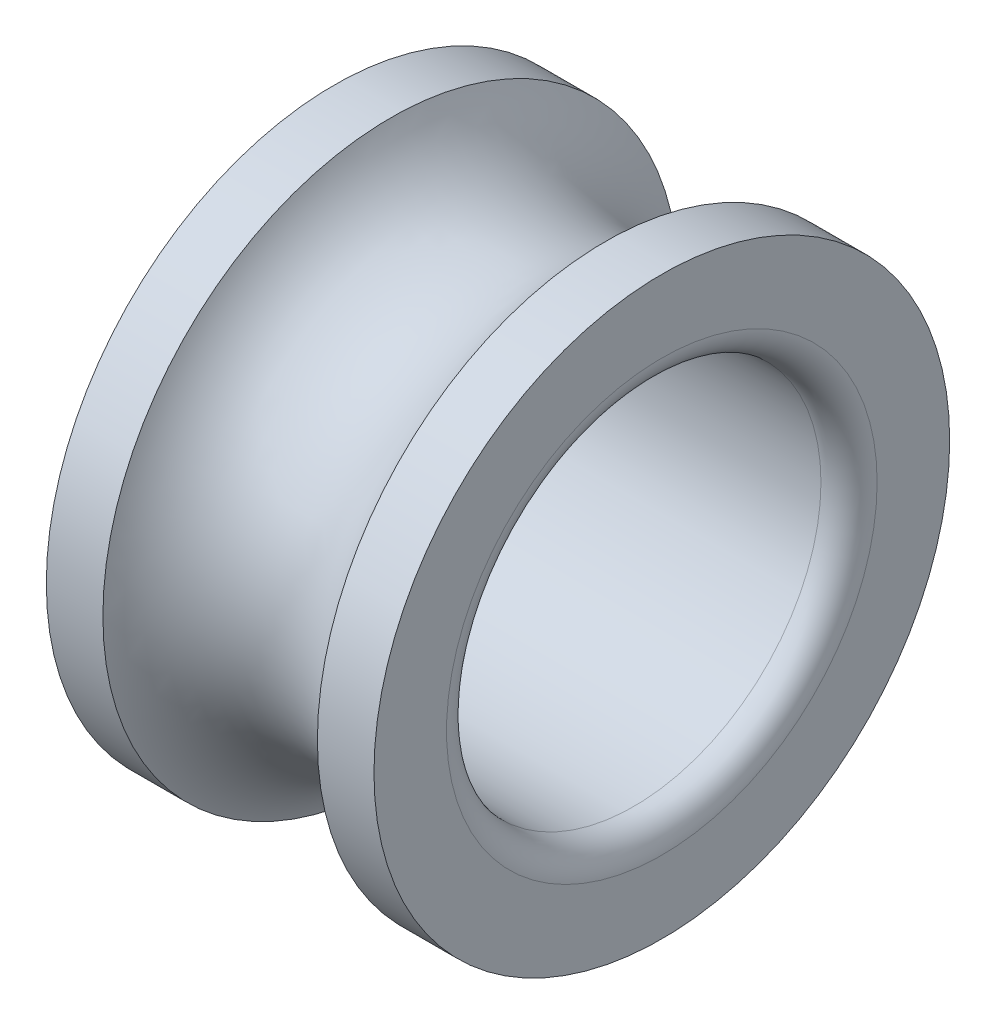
ISO-10303-21;
HEADER;
FILE_DESCRIPTION(('STEP AP214'),'2;1');
FILE_NAME('part.step','',(''),(''),'','','');
FILE_SCHEMA(('AUTOMOTIVE_DESIGN { 1 0 10303 214 1 1 1 1 }'));
ENDSEC;
DATA;
#1=APPLICATION_CONTEXT('core data for automotive mechanical design processes');
#2=APPLICATION_PROTOCOL_DEFINITION('international standard','automotive_design',2000,#1);
#3=PRODUCT_CONTEXT('',#1,'mechanical');
#4=PRODUCT('Part','Part','',(#3));
#5=PRODUCT_RELATED_PRODUCT_CATEGORY('part','',(#4));
#6=PRODUCT_DEFINITION_FORMATION('','',#4);
#7=PRODUCT_DEFINITION_CONTEXT('part definition',#1,'design');
#8=PRODUCT_DEFINITION('design','',#6,#7);
#9=PRODUCT_DEFINITION_SHAPE('','',#8);
#10=(LENGTH_UNIT() NAMED_UNIT(*) SI_UNIT(.MILLI.,.METRE.));
#11=(NAMED_UNIT(*) PLANE_ANGLE_UNIT() SI_UNIT($,.RADIAN.));
#12=(NAMED_UNIT(*) SI_UNIT($,.STERADIAN.) SOLID_ANGLE_UNIT());
#13=UNCERTAINTY_MEASURE_WITH_UNIT(LENGTH_MEASURE(1.E-05),#10,'distance_accuracy_value','');
#14=(GEOMETRIC_REPRESENTATION_CONTEXT(3) GLOBAL_UNCERTAINTY_ASSIGNED_CONTEXT((#13)) GLOBAL_UNIT_ASSIGNED_CONTEXT((#10,
#11,#12)) REPRESENTATION_CONTEXT('',''));
#15=CARTESIAN_POINT('',(0.,0.,0.));
#16=DIRECTION('',(0.,0.,1.));
#17=DIRECTION('',(1.,0.,0.));
#18=AXIS2_PLACEMENT_3D('',#15,#16,#17);
#19=CARTESIAN_POINT('',(0.600000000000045,0.,0.));
#20=DIRECTION('',(1.,0.,0.));
#21=DIRECTION('',(0.,0.,-1.));
#22=AXIS2_PLACEMENT_3D('',#19,#20,#21);
#23=TOROIDAL_SURFACE('',#22,4.60000000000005,0.600000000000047);
#24=CARTESIAN_POINT('',(0.600000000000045,0.,0.));
#25=DIRECTION('',(1.,0.,0.));
#26=DIRECTION('',(0.,0.,-1.));
#27=AXIS2_PLACEMENT_3D('',#24,#25,#26);
#28=CIRCLE('',#27,4.);
#29=CARTESIAN_POINT('',(0.600000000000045,0.,-4.));
#30=VERTEX_POINT('',#29);
#31=EDGE_CURVE('E10',#30,#30,#28,.T.);
#32=ORIENTED_EDGE('',*,*,#31,.T.);
#33=EDGE_LOOP('',(#32));
#34=FACE_BOUND('',#33,.T.);
#35=CARTESIAN_POINT('',(0.,0.,0.));
#36=DIRECTION('',(1.,0.,0.));
#37=DIRECTION('',(0.,0.,-1.));
#38=AXIS2_PLACEMENT_3D('',#35,#36,#37);
#39=CIRCLE('',#38,4.60000000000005);
#40=CARTESIAN_POINT('',(0.,0.,-4.60000000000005));
#41=VERTEX_POINT('',#40);
#42=EDGE_CURVE('E64',#41,#41,#39,.T.);
#43=ORIENTED_EDGE('',*,*,#42,.F.);
#44=EDGE_LOOP('',(#43));
#45=FACE_BOUND('',#44,.T.);
#46=ADVANCED_FACE('F36',(#34,#45),#23,.T.);
#47=CARTESIAN_POINT('',(9.00000000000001,0.,0.));
#48=DIRECTION('',(1.,0.,0.));
#49=DIRECTION('',(0.,0.,-1.));
#50=AXIS2_PLACEMENT_3D('',#47,#48,#49);
#51=CYLINDRICAL_SURFACE('',#50,4.);
#52=CARTESIAN_POINT('',(6.39999999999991,0.,0.));
#53=DIRECTION('',(1.,0.,0.));
#54=DIRECTION('',(0.,0.,-1.));
#55=AXIS2_PLACEMENT_3D('',#52,#53,#54);
#56=CIRCLE('',#55,4.);
#57=CARTESIAN_POINT('',(6.39999999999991,0.,-4.));
#58=VERTEX_POINT('',#57);
#59=EDGE_CURVE('E42',#58,#58,#56,.T.);
#60=ORIENTED_EDGE('',*,*,#59,.T.);
#61=EDGE_LOOP('',(#60));
#62=FACE_BOUND('',#61,.T.);
#63=ORIENTED_EDGE('',*,*,#31,.F.);
#64=EDGE_LOOP('',(#63));
#65=FACE_BOUND('',#64,.T.);
#66=ADVANCED_FACE('F72',(#62,#65),#51,.F.);
#67=CARTESIAN_POINT('',(6.39999999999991,0.,0.));
#68=DIRECTION('',(1.,0.,0.));
#69=DIRECTION('',(0.,0.,-1.));
#70=AXIS2_PLACEMENT_3D('',#67,#68,#69);
#71=TOROIDAL_SURFACE('',#70,4.6000000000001,0.600000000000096);
#72=CARTESIAN_POINT('',(7.00000000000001,0.,0.));
#73=DIRECTION('',(1.,0.,0.));
#74=DIRECTION('',(0.,0.,-1.));
#75=AXIS2_PLACEMENT_3D('',#72,#73,#74);
#76=CIRCLE('',#75,4.6000000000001);
#77=CARTESIAN_POINT('',(7.00000000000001,0.,-4.6000000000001));
#78=VERTEX_POINT('',#77);
#79=EDGE_CURVE('E46',#78,#78,#76,.T.);
#80=ORIENTED_EDGE('',*,*,#79,.T.);
#81=EDGE_LOOP('',(#80));
#82=FACE_BOUND('',#81,.T.);
#83=ORIENTED_EDGE('',*,*,#59,.F.);
#84=EDGE_LOOP('',(#83));
#85=FACE_BOUND('',#84,.T.);
#86=ADVANCED_FACE('F76',(#82,#85),#71,.T.);
#87=CARTESIAN_POINT('',(7.00000000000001,4.60000000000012,0.));
#88=DIRECTION('',(1.,0.,0.));
#89=DIRECTION('',(0.,0.,-1.));
#90=AXIS2_PLACEMENT_3D('',#87,#88,#89);
#91=PLANE('',#90);
#92=CARTESIAN_POINT('',(7.00000000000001,0.,0.));
#93=DIRECTION('',(1.,0.,0.));
#94=DIRECTION('',(0.,0.,-1.));
#95=AXIS2_PLACEMENT_3D('',#92,#93,#94);
#96=CIRCLE('',#95,6.15);
#97=CARTESIAN_POINT('',(7.00000000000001,0.,-6.15));
#98=VERTEX_POINT('',#97);
#99=EDGE_CURVE('E50',#98,#98,#96,.T.);
#100=ORIENTED_EDGE('',*,*,#99,.T.);
#101=EDGE_LOOP('',(#100));
#102=FACE_BOUND('',#101,.T.);
#103=ORIENTED_EDGE('',*,*,#79,.F.);
#104=EDGE_LOOP('',(#103));
#105=FACE_BOUND('',#104,.T.);
#106=ADVANCED_FACE('F80',(#102,#105),#91,.T.);
#107=CARTESIAN_POINT('',(9.00000000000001,0.,0.));
#108=DIRECTION('',(1.,0.,0.));
#109=DIRECTION('',(0.,0.,-1.));
#110=AXIS2_PLACEMENT_3D('',#107,#108,#109);
#111=CYLINDRICAL_SURFACE('',#110,6.15);
#112=CARTESIAN_POINT('',(5.79128784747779,0.,0.));
#113=DIRECTION('',(1.,0.,0.));
#114=DIRECTION('',(0.,0.,-1.));
#115=AXIS2_PLACEMENT_3D('',#112,#113,#114);
#116=CIRCLE('',#115,6.15);
#117=CARTESIAN_POINT('',(5.79128784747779,0.,-6.15));
#118=VERTEX_POINT('',#117);
#119=EDGE_CURVE('E55',#118,#118,#116,.T.);
#120=ORIENTED_EDGE('',*,*,#119,.T.);
#121=EDGE_LOOP('',(#120));
#122=FACE_BOUND('',#121,.T.);
#123=ORIENTED_EDGE('',*,*,#99,.F.);
#124=EDGE_LOOP('',(#123));
#125=FACE_BOUND('',#124,.T.);
#126=ADVANCED_FACE('F87',(#122,#125),#111,.T.);
#127=CARTESIAN_POINT('',(3.49999999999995,0.,0.));
#128=DIRECTION('',(1.,0.,0.));
#129=DIRECTION('',(0.,0.,-1.));
#130=AXIS2_PLACEMENT_3D('',#127,#128,#129);
#131=TOROIDAL_SURFACE('',#130,7.15000000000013,2.5);
#132=CARTESIAN_POINT('',(1.20871215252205,0.,0.));
#133=DIRECTION('',(1.,0.,0.));
#134=DIRECTION('',(0.,0.,-1.));
#135=AXIS2_PLACEMENT_3D('',#132,#133,#134);
#136=CIRCLE('',#135,6.15);
#137=CARTESIAN_POINT('',(1.20871215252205,0.,-6.15000000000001));
#138=VERTEX_POINT('',#137);
#139=EDGE_CURVE('E58',#138,#138,#136,.T.);
#140=ORIENTED_EDGE('',*,*,#139,.T.);
#141=EDGE_LOOP('',(#140));
#142=FACE_BOUND('',#141,.T.);
#143=ORIENTED_EDGE('',*,*,#119,.F.);
#144=EDGE_LOOP('',(#143));
#145=FACE_BOUND('',#144,.T.);
#146=ADVANCED_FACE('F91',(#142,#145),#131,.F.);
#147=CARTESIAN_POINT('',(9.00000000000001,0.,0.));
#148=DIRECTION('',(1.,0.,0.));
#149=DIRECTION('',(0.,0.,-1.));
#150=AXIS2_PLACEMENT_3D('',#147,#148,#149);
#151=CYLINDRICAL_SURFACE('',#150,6.15);
#152=CARTESIAN_POINT('',(0.,0.,0.));
#153=DIRECTION('',(1.,0.,0.));
#154=DIRECTION('',(0.,0.,-1.));
#155=AXIS2_PLACEMENT_3D('',#152,#153,#154);
#156=CIRCLE('',#155,6.15);
#157=CARTESIAN_POINT('',(0.,0.,-6.15000000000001));
#158=VERTEX_POINT('',#157);
#159=EDGE_CURVE('E61',#158,#158,#156,.T.);
#160=ORIENTED_EDGE('',*,*,#159,.T.);
#161=EDGE_LOOP('',(#160));
#162=FACE_BOUND('',#161,.T.);
#163=ORIENTED_EDGE('',*,*,#139,.F.);
#164=EDGE_LOOP('',(#163));
#165=FACE_BOUND('',#164,.T.);
#166=ADVANCED_FACE('F95',(#162,#165),#151,.T.);
#167=CARTESIAN_POINT('',(0.,6.15000000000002,0.));
#168=DIRECTION('',(-1.,0.,0.));
#169=DIRECTION('',(0.,0.,1.));
#170=AXIS2_PLACEMENT_3D('',#167,#168,#169);
#171=PLANE('',#170);
#172=ORIENTED_EDGE('',*,*,#42,.T.);
#173=EDGE_LOOP('',(#172));
#174=FACE_BOUND('',#173,.T.);
#175=ORIENTED_EDGE('',*,*,#159,.F.);
#176=EDGE_LOOP('',(#175));
#177=FACE_BOUND('',#176,.T.);
#178=ADVANCED_FACE('F68',(#174,#177),#171,.T.);
#179=CLOSED_SHELL('',(#46,#66,#86,#106,#126,#146,#166,#178));
#180=MANIFOLD_SOLID_BREP('B2',#179);
#181=ADVANCED_BREP_SHAPE_REPRESENTATION('',(#18,#180),#14);
#182=SHAPE_DEFINITION_REPRESENTATION(#9,#181);
ENDSEC;
END-ISO-10303-21;
